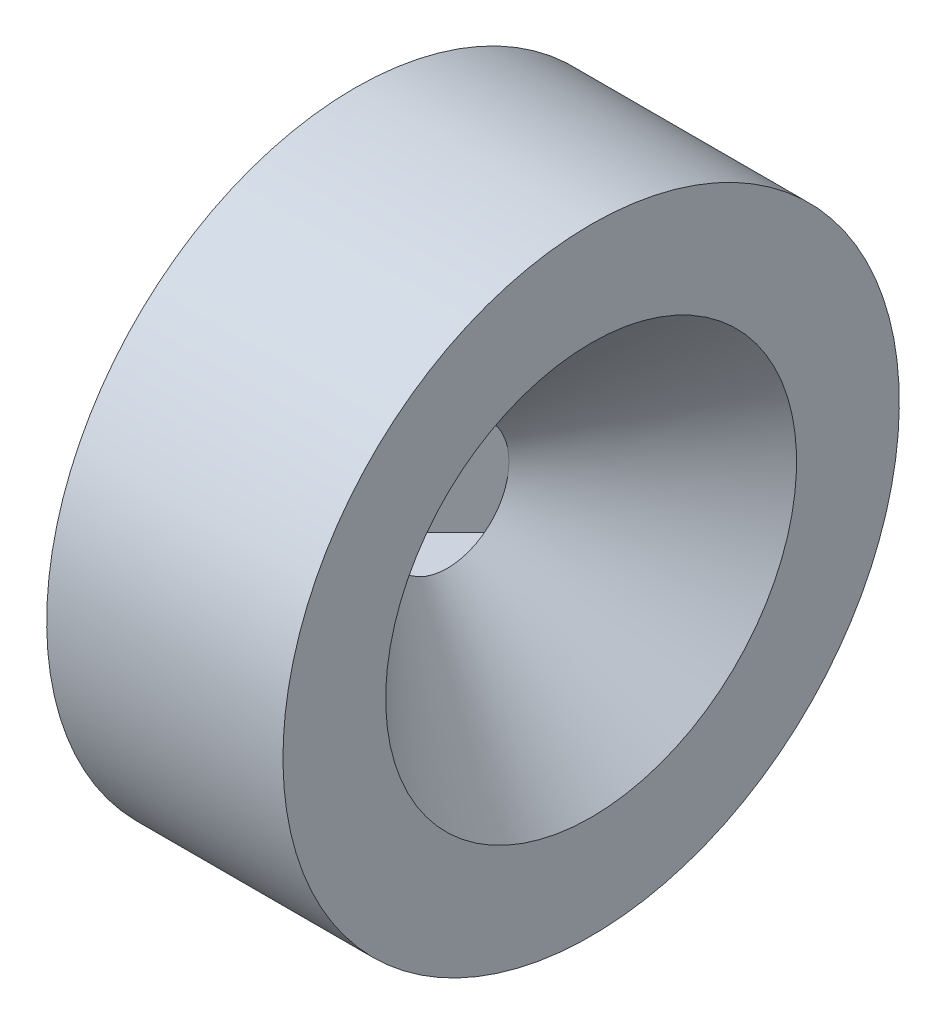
ISO-10303-21;
HEADER;
FILE_DESCRIPTION(('STEP AP214'),'2;1');
FILE_NAME('part.step','',(''),(''),'','','');
FILE_SCHEMA(('AUTOMOTIVE_DESIGN { 1 0 10303 214 1 1 1 1 }'));
ENDSEC;
DATA;
#1=APPLICATION_CONTEXT('core data for automotive mechanical design processes');
#2=APPLICATION_PROTOCOL_DEFINITION('international standard','automotive_design',2000,#1);
#3=PRODUCT_CONTEXT('',#1,'mechanical');
#4=PRODUCT('Part','Part','',(#3));
#5=PRODUCT_RELATED_PRODUCT_CATEGORY('part','',(#4));
#6=PRODUCT_DEFINITION_FORMATION('','',#4);
#7=PRODUCT_DEFINITION_CONTEXT('part definition',#1,'design');
#8=PRODUCT_DEFINITION('design','',#6,#7);
#9=PRODUCT_DEFINITION_SHAPE('','',#8);
#10=(LENGTH_UNIT() NAMED_UNIT(*) SI_UNIT(.MILLI.,.METRE.));
#11=(NAMED_UNIT(*) PLANE_ANGLE_UNIT() SI_UNIT($,.RADIAN.));
#12=(NAMED_UNIT(*) SI_UNIT($,.STERADIAN.) SOLID_ANGLE_UNIT());
#13=UNCERTAINTY_MEASURE_WITH_UNIT(LENGTH_MEASURE(1.E-05),#10,'distance_accuracy_value','');
#14=(GEOMETRIC_REPRESENTATION_CONTEXT(3) GLOBAL_UNCERTAINTY_ASSIGNED_CONTEXT((#13)) GLOBAL_UNIT_ASSIGNED_CONTEXT((#10,
#11,#12)) REPRESENTATION_CONTEXT('',''));
#15=CARTESIAN_POINT('',(0.,0.,0.));
#16=DIRECTION('',(0.,0.,1.));
#17=DIRECTION('',(1.,0.,0.));
#18=AXIS2_PLACEMENT_3D('',#15,#16,#17);
#19=CARTESIAN_POINT('',(4.5,-3.,3.));
#20=DIRECTION('',(1.,0.,0.));
#21=DIRECTION('',(0.,0.,-1.));
#22=AXIS2_PLACEMENT_3D('',#19,#20,#21);
#23=PLANE('',#22);
#24=CARTESIAN_POINT('',(4.49999999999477,0.,0.));
#25=DIRECTION('',(-1.,0.,0.));
#26=DIRECTION('',(0.,-1.,0.));
#27=AXIS2_PLACEMENT_3D('',#24,#25,#26);
#28=CIRCLE('',#27,2.99999999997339);
#29=CARTESIAN_POINT('',(4.49999999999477,-2.99999999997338,0.));
#30=VERTEX_POINT('',#29);
#31=CARTESIAN_POINT('',(4.49999999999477,0.,2.99999999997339));
#32=VERTEX_POINT('',#31);
#33=EDGE_CURVE('E88',#30,#32,#28,.T.);
#34=ORIENTED_EDGE('',*,*,#33,.F.);
#35=DIRECTION('',(0.,0.,-1.));
#36=VECTOR('',#35,1.);
#37=CARTESIAN_POINT('',(4.5,-3.,3.));
#38=LINE('',#37,#36);
#39=CARTESIAN_POINT('',(4.5,-3.,3.));
#40=VERTEX_POINT('',#39);
#41=EDGE_CURVE('E102',#40,#30,#38,.T.);
#42=ORIENTED_EDGE('',*,*,#41,.F.);
#43=DIRECTION('',(0.,1.,0.));
#44=VECTOR('',#43,1.);
#45=CARTESIAN_POINT('',(4.5,-3.,3.));
#46=LINE('',#45,#44);
#47=EDGE_CURVE('E104',#40,#32,#46,.T.);
#48=ORIENTED_EDGE('',*,*,#47,.T.);
#49=EDGE_LOOP('',(#34,#42,#48));
#50=FACE_BOUND('',#49,.T.);
#51=ADVANCED_FACE('F33',(#50),#23,.F.);
#52=CARTESIAN_POINT('',(4.49999999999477,2.9999999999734,0.));
#53=VERTEX_POINT('',#52);
#54=EDGE_CURVE('E106',#32,#53,#28,.T.);
#55=ORIENTED_EDGE('',*,*,#54,.F.);
#56=CARTESIAN_POINT('',(4.5,3.,3.));
#57=VERTEX_POINT('',#56);
#58=EDGE_CURVE('E132',#32,#57,#46,.T.);
#59=ORIENTED_EDGE('',*,*,#58,.T.);
#60=DIRECTION('',(0.,0.,-1.));
#61=VECTOR('',#60,1.);
#62=CARTESIAN_POINT('',(4.5,3.,3.));
#63=LINE('',#62,#61);
#64=EDGE_CURVE('E123',#57,#53,#63,.T.);
#65=ORIENTED_EDGE('',*,*,#64,.T.);
#66=EDGE_LOOP('',(#55,#59,#65));
#67=FACE_BOUND('',#66,.T.);
#68=ADVANCED_FACE('F160',(#67),#23,.F.);
#69=CARTESIAN_POINT('',(4.49999999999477,0.,-3.));
#70=VERTEX_POINT('',#69);
#71=EDGE_CURVE('E91',#53,#70,#28,.T.);
#72=ORIENTED_EDGE('',*,*,#71,.F.);
#73=CARTESIAN_POINT('',(4.5,3.,-3.));
#74=VERTEX_POINT('',#73);
#75=EDGE_CURVE('E127',#53,#74,#63,.T.);
#76=ORIENTED_EDGE('',*,*,#75,.T.);
#77=DIRECTION('',(0.,1.,0.));
#78=VECTOR('',#77,1.);
#79=CARTESIAN_POINT('',(4.5,-3.,-3.));
#80=LINE('',#79,#78);
#81=EDGE_CURVE('E122',#70,#74,#80,.T.);
#82=ORIENTED_EDGE('',*,*,#81,.F.);
#83=EDGE_LOOP('',(#72,#76,#82));
#84=FACE_BOUND('',#83,.T.);
#85=ADVANCED_FACE('F203',(#84),#23,.F.);
#86=EDGE_CURVE('E85',#70,#30,#28,.T.);
#87=ORIENTED_EDGE('',*,*,#86,.F.);
#88=CARTESIAN_POINT('',(4.5,-3.,-3.));
#89=VERTEX_POINT('',#88);
#90=EDGE_CURVE('E110',#89,#70,#80,.T.);
#91=ORIENTED_EDGE('',*,*,#90,.F.);
#92=EDGE_CURVE('E107',#30,#89,#38,.T.);
#93=ORIENTED_EDGE('',*,*,#92,.F.);
#94=EDGE_LOOP('',(#87,#91,#93));
#95=FACE_BOUND('',#94,.T.);
#96=ADVANCED_FACE('F108',(#95),#23,.F.);
#97=CARTESIAN_POINT('',(1.5,-3.,0.));
#98=DIRECTION('',(-0.707106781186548,0.,0.707106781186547));
#99=DIRECTION('',(0.707106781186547,0.,0.707106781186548));
#100=AXIS2_PLACEMENT_3D('',#97,#98,#99);
#101=PLANE('',#100);
#102=DIRECTION('',(0.707106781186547,0.,0.707106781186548));
#103=VECTOR('',#102,1.);
#104=CARTESIAN_POINT('',(1.5,-3.,0.));
#105=LINE('',#104,#103);
#106=CARTESIAN_POINT('',(1.64142135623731,-3.,0.141421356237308));
#107=VERTEX_POINT('',#106);
#108=EDGE_CURVE('E116',#107,#40,#105,.T.);
#109=ORIENTED_EDGE('',*,*,#108,.F.);
#110=DIRECTION('',(0.,1.,0.));
#111=VECTOR('',#110,1.);
#112=CARTESIAN_POINT('',(1.64142135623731,3.,0.141421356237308));
#113=LINE('',#112,#111);
#114=CARTESIAN_POINT('',(1.64142135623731,3.,0.141421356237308));
#115=VERTEX_POINT('',#114);
#116=EDGE_CURVE('E145',#107,#115,#113,.T.);
#117=ORIENTED_EDGE('',*,*,#116,.T.);
#118=DIRECTION('',(0.707106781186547,0.,0.707106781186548));
#119=VECTOR('',#118,1.);
#120=CARTESIAN_POINT('',(1.5,3.,0.));
#121=LINE('',#120,#119);
#122=EDGE_CURVE('E112',#115,#57,#121,.T.);
#123=ORIENTED_EDGE('',*,*,#122,.T.);
#124=ORIENTED_EDGE('',*,*,#58,.F.);
#125=ORIENTED_EDGE('',*,*,#47,.F.);
#126=EDGE_LOOP('',(#109,#117,#123,#124,#125));
#127=FACE_BOUND('',#126,.T.);
#128=ADVANCED_FACE('F150',(#127),#101,.F.);
#129=CARTESIAN_POINT('',(4.5,-3.,-3.));
#130=DIRECTION('',(-0.707106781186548,0.,-0.707106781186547));
#131=DIRECTION('',(-0.707106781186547,0.,0.707106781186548));
#132=AXIS2_PLACEMENT_3D('',#129,#130,#131);
#133=PLANE('',#132);
#134=DIRECTION('',(-0.707106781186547,0.,0.707106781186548));
#135=VECTOR('',#134,1.);
#136=CARTESIAN_POINT('',(4.5,3.,-3.));
#137=LINE('',#136,#135);
#138=CARTESIAN_POINT('',(1.64142135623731,3.,-0.141421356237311));
#139=VERTEX_POINT('',#138);
#140=EDGE_CURVE('E126',#74,#139,#137,.T.);
#141=ORIENTED_EDGE('',*,*,#140,.T.);
#142=DIRECTION('',(0.,1.,0.));
#143=VECTOR('',#142,1.);
#144=CARTESIAN_POINT('',(1.64142135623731,-3.,-0.141421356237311));
#145=LINE('',#144,#143);
#146=CARTESIAN_POINT('',(1.64142135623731,-3.,-0.141421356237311));
#147=VERTEX_POINT('',#146);
#148=EDGE_CURVE('E41',#139,#147,#145,.F.);
#149=ORIENTED_EDGE('',*,*,#148,.T.);
#150=DIRECTION('',(-0.707106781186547,0.,0.707106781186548));
#151=VECTOR('',#150,1.);
#152=CARTESIAN_POINT('',(4.5,-3.,-3.));
#153=LINE('',#152,#151);
#154=EDGE_CURVE('E117',#89,#147,#153,.T.);
#155=ORIENTED_EDGE('',*,*,#154,.F.);
#156=ORIENTED_EDGE('',*,*,#90,.T.);
#157=ORIENTED_EDGE('',*,*,#81,.T.);
#158=EDGE_LOOP('',(#141,#149,#155,#156,#157));
#159=FACE_BOUND('',#158,.T.);
#160=ADVANCED_FACE('F210',(#159),#133,.F.);
#161=CARTESIAN_POINT('',(0.,-3.,0.));
#162=DIRECTION('',(0.,1.,0.));
#163=DIRECTION('',(0.,0.,1.));
#164=AXIS2_PLACEMENT_3D('',#161,#162,#163);
#165=PLANE('',#164);
#166=ORIENTED_EDGE('',*,*,#154,.T.);
#167=CARTESIAN_POINT('',(1.78284271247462,-3.,0.));
#168=DIRECTION('',(0.,1.,0.));
#169=DIRECTION('',(0.,0.,1.));
#170=AXIS2_PLACEMENT_3D('',#167,#168,#169);
#171=CIRCLE('',#170,0.2);
#172=EDGE_CURVE('E11',#147,#107,#171,.T.);
#173=ORIENTED_EDGE('',*,*,#172,.T.);
#174=ORIENTED_EDGE('',*,*,#108,.T.);
#175=ORIENTED_EDGE('',*,*,#41,.T.);
#176=ORIENTED_EDGE('',*,*,#92,.T.);
#177=EDGE_LOOP('',(#166,#173,#174,#175,#176));
#178=FACE_BOUND('',#177,.T.);
#179=ADVANCED_FACE('F114',(#178),#165,.T.);
#180=CARTESIAN_POINT('',(0.,3.,0.));
#181=DIRECTION('',(0.,1.,0.));
#182=DIRECTION('',(0.,0.,1.));
#183=AXIS2_PLACEMENT_3D('',#180,#181,#182);
#184=PLANE('',#183);
#185=ORIENTED_EDGE('',*,*,#122,.F.);
#186=CARTESIAN_POINT('',(1.78284271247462,3.,0.));
#187=DIRECTION('',(0.,1.,0.));
#188=DIRECTION('',(0.,0.,1.));
#189=AXIS2_PLACEMENT_3D('',#186,#187,#188);
#190=CIRCLE('',#189,0.2);
#191=EDGE_CURVE('E55',#115,#139,#190,.F.);
#192=ORIENTED_EDGE('',*,*,#191,.T.);
#193=ORIENTED_EDGE('',*,*,#140,.F.);
#194=ORIENTED_EDGE('',*,*,#75,.F.);
#195=ORIENTED_EDGE('',*,*,#64,.F.);
#196=EDGE_LOOP('',(#185,#192,#193,#194,#195));
#197=FACE_BOUND('',#196,.T.);
#198=ADVANCED_FACE('F156',(#197),#184,.F.);
#199=CARTESIAN_POINT('',(4.49999999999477,0.,0.));
#200=DIRECTION('',(1.,0.,0.));
#201=DIRECTION('',(0.,1.,0.));
#202=AXIS2_PLACEMENT_3D('',#199,#200,#201);
#203=CONICAL_SURFACE('',#202,2.99999999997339,0.785398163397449);
#204=CARTESIAN_POINT('',(11.4999999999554,0.,0.));
#205=DIRECTION('',(-1.,0.,0.));
#206=DIRECTION('',(0.,-1.,0.));
#207=AXIS2_PLACEMENT_3D('',#204,#205,#206);
#208=CIRCLE('',#207,9.99999999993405);
#209=CARTESIAN_POINT('',(11.4999999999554,-9.99999999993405,0.));
#210=VERTEX_POINT('',#209);
#211=EDGE_CURVE('E105',#210,#210,#208,.T.);
#212=ORIENTED_EDGE('',*,*,#211,.F.);
#213=EDGE_LOOP('',(#212));
#214=FACE_BOUND('',#213,.T.);
#215=ORIENTED_EDGE('',*,*,#33,.T.);
#216=ORIENTED_EDGE('',*,*,#54,.T.);
#217=ORIENTED_EDGE('',*,*,#71,.T.);
#218=ORIENTED_EDGE('',*,*,#86,.T.);
#219=EDGE_LOOP('',(#215,#216,#217,#218));
#220=FACE_BOUND('',#219,.T.);
#221=ADVANCED_FACE('F87',(#214,#220),#203,.F.);
#222=CARTESIAN_POINT('',(0.,15.,0.));
#223=DIRECTION('',(-1.,0.,0.));
#224=DIRECTION('',(0.,-1.,0.));
#225=AXIS2_PLACEMENT_3D('',#222,#223,#224);
#226=PLANE('',#225);
#227=CARTESIAN_POINT('',(0.,0.,0.));
#228=DIRECTION('',(1.,0.,0.));
#229=DIRECTION('',(0.,1.,0.));
#230=AXIS2_PLACEMENT_3D('',#227,#228,#229);
#231=CIRCLE('',#230,15.);
#232=CARTESIAN_POINT('',(0.,15.,0.));
#233=VERTEX_POINT('',#232);
#234=EDGE_CURVE('E142',#233,#233,#231,.T.);
#235=ORIENTED_EDGE('',*,*,#234,.F.);
#236=EDGE_LOOP('',(#235));
#237=FACE_BOUND('',#236,.T.);
#238=CARTESIAN_POINT('',(0.,0.,0.));
#239=DIRECTION('',(-1.,0.,0.));
#240=DIRECTION('',(0.,-1.,0.));
#241=AXIS2_PLACEMENT_3D('',#238,#239,#240);
#242=CIRCLE('',#241,6.);
#243=CARTESIAN_POINT('',(0.,6.,0.));
#244=VERTEX_POINT('',#243);
#245=EDGE_CURVE('E131',#244,#244,#242,.T.);
#246=ORIENTED_EDGE('',*,*,#245,.F.);
#247=EDGE_LOOP('',(#246));
#248=FACE_BOUND('',#247,.T.);
#249=ADVANCED_FACE('F184',(#237,#248),#226,.T.);
#250=CARTESIAN_POINT('',(0.,0.,0.));
#251=DIRECTION('',(1.,0.,0.));
#252=DIRECTION('',(0.,1.,0.));
#253=AXIS2_PLACEMENT_3D('',#250,#251,#252);
#254=CYLINDRICAL_SURFACE('',#253,15.);
#255=ORIENTED_EDGE('',*,*,#234,.T.);
#256=EDGE_LOOP('',(#255));
#257=FACE_BOUND('',#256,.T.);
#258=CARTESIAN_POINT('',(11.5,0.,0.));
#259=DIRECTION('',(1.,0.,0.));
#260=DIRECTION('',(0.,1.,0.));
#261=AXIS2_PLACEMENT_3D('',#258,#259,#260);
#262=CIRCLE('',#261,15.);
#263=CARTESIAN_POINT('',(11.5,15.,0.));
#264=VERTEX_POINT('',#263);
#265=EDGE_CURVE('E137',#264,#264,#262,.T.);
#266=ORIENTED_EDGE('',*,*,#265,.F.);
#267=EDGE_LOOP('',(#266));
#268=FACE_BOUND('',#267,.T.);
#269=ADVANCED_FACE('F186',(#257,#268),#254,.T.);
#270=CARTESIAN_POINT('',(11.5,0.,0.));
#271=DIRECTION('',(1.,0.,0.));
#272=DIRECTION('',(0.,1.,0.));
#273=AXIS2_PLACEMENT_3D('',#270,#271,#272);
#274=PLANE('',#273);
#275=ORIENTED_EDGE('',*,*,#211,.T.);
#276=EDGE_LOOP('',(#275));
#277=FACE_BOUND('',#276,.T.);
#278=ORIENTED_EDGE('',*,*,#265,.T.);
#279=EDGE_LOOP('',(#278));
#280=FACE_BOUND('',#279,.T.);
#281=ADVANCED_FACE('F180',(#277,#280),#274,.T.);
#282=CARTESIAN_POINT('',(-5.,0.,0.));
#283=DIRECTION('',(1.,0.,0.));
#284=DIRECTION('',(0.,1.,0.));
#285=AXIS2_PLACEMENT_3D('',#282,#283,#284);
#286=CYLINDRICAL_SURFACE('',#285,6.);
#287=CARTESIAN_POINT('',(-5.,0.,0.));
#288=DIRECTION('',(-1.,0.,0.));
#289=DIRECTION('',(0.,-1.,0.));
#290=AXIS2_PLACEMENT_3D('',#287,#288,#289);
#291=CIRCLE('',#290,6.);
#292=CARTESIAN_POINT('',(-5.,6.,0.));
#293=VERTEX_POINT('',#292);
#294=EDGE_CURVE('E134',#293,#293,#291,.T.);
#295=CARTESIAN_POINT('',(-5.,6.,0.));
#296=CARTESIAN_POINT('',(-4.94791666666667,6.,0.));
#297=CARTESIAN_POINT('',(-4.89583333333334,6.,0.));
#298=CARTESIAN_POINT('',(-4.79166666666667,6.,0.));
#299=CARTESIAN_POINT('',(-4.73958333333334,6.,0.));
#300=CARTESIAN_POINT('',(-4.63541666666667,6.,0.));
#301=CARTESIAN_POINT('',(-4.58333333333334,6.,0.));
#302=CARTESIAN_POINT('',(-4.47916666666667,6.,0.));
#303=CARTESIAN_POINT('',(-4.42708333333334,6.,0.));
#304=CARTESIAN_POINT('',(-4.32291666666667,6.,0.));
#305=CARTESIAN_POINT('',(-4.27083333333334,6.,0.));
#306=CARTESIAN_POINT('',(-4.16666666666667,6.,0.));
#307=CARTESIAN_POINT('',(-4.11458333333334,6.,0.));
#308=CARTESIAN_POINT('',(-4.01041666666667,6.,0.));
#309=CARTESIAN_POINT('',(-3.95833333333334,6.,0.));
#310=CARTESIAN_POINT('',(-3.85416666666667,6.,0.));
#311=CARTESIAN_POINT('',(-3.80208333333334,6.,0.));
#312=CARTESIAN_POINT('',(-3.69791666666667,6.,0.));
#313=CARTESIAN_POINT('',(-3.64583333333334,6.,0.));
#314=CARTESIAN_POINT('',(-3.54166666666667,6.,0.));
#315=CARTESIAN_POINT('',(-3.48958333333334,6.,0.));
#316=CARTESIAN_POINT('',(-3.38541666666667,6.,0.));
#317=CARTESIAN_POINT('',(-3.33333333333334,6.,0.));
#318=CARTESIAN_POINT('',(-3.22916666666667,6.,0.));
#319=CARTESIAN_POINT('',(-3.17708333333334,6.,0.));
#320=CARTESIAN_POINT('',(-3.07291666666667,6.,0.));
#321=CARTESIAN_POINT('',(-3.02083333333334,6.,0.));
#322=CARTESIAN_POINT('',(-2.91666666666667,6.,0.));
#323=CARTESIAN_POINT('',(-2.86458333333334,6.,0.));
#324=CARTESIAN_POINT('',(-2.76041666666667,6.,0.));
#325=CARTESIAN_POINT('',(-2.70833333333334,6.,0.));
#326=CARTESIAN_POINT('',(-2.60416666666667,6.,0.));
#327=CARTESIAN_POINT('',(-2.55208333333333,6.,0.));
#328=CARTESIAN_POINT('',(-2.44791666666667,6.,0.));
#329=CARTESIAN_POINT('',(-2.39583333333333,6.,0.));
#330=CARTESIAN_POINT('',(-2.29166666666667,6.,0.));
#331=CARTESIAN_POINT('',(-2.23958333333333,6.,0.));
#332=CARTESIAN_POINT('',(-2.13541666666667,6.,0.));
#333=CARTESIAN_POINT('',(-2.08333333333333,6.,0.));
#334=CARTESIAN_POINT('',(-1.97916666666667,6.,0.));
#335=CARTESIAN_POINT('',(-1.92708333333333,6.,0.));
#336=CARTESIAN_POINT('',(-1.82291666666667,6.,0.));
#337=CARTESIAN_POINT('',(-1.77083333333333,6.,0.));
#338=CARTESIAN_POINT('',(-1.66666666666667,6.,0.));
#339=CARTESIAN_POINT('',(-1.61458333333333,6.,0.));
#340=CARTESIAN_POINT('',(-1.51041666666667,6.,0.));
#341=CARTESIAN_POINT('',(-1.45833333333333,6.,0.));
#342=CARTESIAN_POINT('',(-1.35416666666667,6.,0.));
#343=CARTESIAN_POINT('',(-1.30208333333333,6.,0.));
#344=CARTESIAN_POINT('',(-1.19791666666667,6.,0.));
#345=CARTESIAN_POINT('',(-1.14583333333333,6.,0.));
#346=CARTESIAN_POINT('',(-1.04166666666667,6.,0.));
#347=CARTESIAN_POINT('',(-0.989583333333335,6.,0.));
#348=CARTESIAN_POINT('',(-0.885416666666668,6.,0.));
#349=CARTESIAN_POINT('',(-0.833333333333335,6.,0.));
#350=CARTESIAN_POINT('',(-0.729166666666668,6.,0.));
#351=CARTESIAN_POINT('',(-0.677083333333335,6.,0.));
#352=CARTESIAN_POINT('',(-0.572916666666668,6.,0.));
#353=CARTESIAN_POINT('',(-0.520833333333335,6.,0.));
#354=CARTESIAN_POINT('',(-0.416666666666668,6.,0.));
#355=CARTESIAN_POINT('',(-0.364583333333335,6.,0.));
#356=CARTESIAN_POINT('',(-0.260416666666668,6.,0.));
#357=CARTESIAN_POINT('',(-0.208333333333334,6.,0.));
#358=CARTESIAN_POINT('',(-0.104166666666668,6.,0.));
#359=CARTESIAN_POINT('',(-0.0520833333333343,6.,0.));
#360=CARTESIAN_POINT('',(0.,6.,0.));
#361=B_SPLINE_CURVE_WITH_KNOTS('',3,(#295,#296,#297,#298,#299,#300,#301,#302,#303,#304,#305,
#306,#307,#308,#309,#310,#311,#312,#313,#314,#315,#316,#317,#318,#319,#320,#321,#322,#323,#324,
#325,#326,#327,#328,#329,#330,#331,#332,#333,#334,#335,#336,#337,#338,#339,#340,#341,#342,#343,
#344,#345,#346,#347,#348,#349,#350,#351,#352,#353,#354,#355,#356,#357,#358,#359,#360),
.UNSPECIFIED.,.F.,.F.,(4,2,2,2,2,2,2,2,2,2,2,2,2,2,2,2,2,2,2,2,2,2,2,2,2,2,2,2,2,2,2,2,4),(0.,
0.15625,0.3125,0.46875,0.625000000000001,0.781250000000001,0.937500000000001,1.09375,1.25,
1.40625,1.5625,1.71875,1.875,2.03125,2.1875,2.34375,2.5,2.65625,2.8125,2.96875,3.125,3.28125,
3.4375,3.59375,3.75,3.90625,4.0625,4.21875,4.375,4.53125,4.6875,4.84375,5.),.UNSPECIFIED.);
#362=EDGE_CURVE('BSEAM174',#293,#244,#361,.T.);
#363=ORIENTED_EDGE('',*,*,#294,.F.);
#364=ORIENTED_EDGE('',*,*,#245,.T.);
#365=ORIENTED_EDGE('',*,*,#362,.T.);
#366=ORIENTED_EDGE('',*,*,#362,.F.);
#367=EDGE_LOOP('',(#363,#365,#364,#366));
#368=FACE_BOUND('',#367,.T.);
#369=ADVANCED_FACE('F174',(#368),#286,.T.);
#370=CARTESIAN_POINT('',(-5.,0.,0.));
#371=DIRECTION('',(-1.,0.,0.));
#372=DIRECTION('',(0.,-1.,0.));
#373=AXIS2_PLACEMENT_3D('',#370,#371,#372);
#374=PLANE('',#373);
#375=CARTESIAN_POINT('',(-5.,0.,0.));
#376=DIRECTION('',(-1.,0.,0.));
#377=DIRECTION('',(0.,0.,1.));
#378=AXIS2_PLACEMENT_3D('',#375,#376,#377);
#379=CIRCLE('',#378,4.99999999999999);
#380=CARTESIAN_POINT('',(-5.,0.,4.99999999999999));
#381=VERTEX_POINT('',#380);
#382=EDGE_CURVE('E164',#381,#381,#379,.T.);
#383=ORIENTED_EDGE('',*,*,#382,.F.);
#384=EDGE_LOOP('',(#383));
#385=FACE_BOUND('',#384,.T.);
#386=ORIENTED_EDGE('',*,*,#294,.T.);
#387=EDGE_LOOP('',(#386));
#388=FACE_BOUND('',#387,.T.);
#389=ADVANCED_FACE('F170',(#385,#388),#374,.T.);
#390=CARTESIAN_POINT('',(0.,0.,0.));
#391=DIRECTION('',(1.,0.,0.));
#392=DIRECTION('',(0.,0.,-1.));
#393=AXIS2_PLACEMENT_3D('',#390,#391,#392);
#394=PLANE('',#393);
#395=CARTESIAN_POINT('',(0.,0.,0.));
#396=DIRECTION('',(-1.,0.,0.));
#397=DIRECTION('',(0.,0.,1.));
#398=AXIS2_PLACEMENT_3D('',#395,#396,#397);
#399=CIRCLE('',#398,4.99999999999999);
#400=CARTESIAN_POINT('',(0.,0.,4.99999999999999));
#401=VERTEX_POINT('',#400);
#402=EDGE_CURVE('E96',#401,#401,#399,.T.);
#403=ORIENTED_EDGE('',*,*,#402,.T.);
#404=EDGE_LOOP('',(#403));
#405=FACE_BOUND('',#404,.T.);
#406=ADVANCED_FACE('F173',(#405),#394,.F.);
#407=CARTESIAN_POINT('',(-5.,0.,0.));
#408=DIRECTION('',(-1.,0.,0.));
#409=DIRECTION('',(0.,0.,1.));
#410=AXIS2_PLACEMENT_3D('',#407,#408,#409);
#411=CYLINDRICAL_SURFACE('',#410,4.99999999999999);
#412=ORIENTED_EDGE('',*,*,#402,.F.);
#413=EDGE_LOOP('',(#412));
#414=FACE_BOUND('',#413,.T.);
#415=ORIENTED_EDGE('',*,*,#382,.T.);
#416=EDGE_LOOP('',(#415));
#417=FACE_BOUND('',#416,.T.);
#418=ADVANCED_FACE('F168',(#414,#417),#411,.F.);
#419=CARTESIAN_POINT('',(1.78284271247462,-3.,0.));
#420=DIRECTION('',(0.,-1.,0.));
#421=DIRECTION('',(0.,0.,-1.));
#422=AXIS2_PLACEMENT_3D('',#419,#420,#421);
#423=CYLINDRICAL_SURFACE('',#422,0.2);
#424=ORIENTED_EDGE('',*,*,#172,.F.);
#425=ORIENTED_EDGE('',*,*,#148,.F.);
#426=ORIENTED_EDGE('',*,*,#191,.F.);
#427=ORIENTED_EDGE('',*,*,#116,.F.);
#428=EDGE_LOOP('',(#424,#425,#426,#427));
#429=FACE_BOUND('',#428,.T.);
#430=ADVANCED_FACE('F35',(#429),#423,.F.);
#431=CLOSED_SHELL('',(#51,#68,#85,#96,#128,#160,#179,#198,#221,#249,#269,#281,#369,#389,#406,
#418,#430));
#432=MANIFOLD_SOLID_BREP('B2',#431);
#433=ADVANCED_BREP_SHAPE_REPRESENTATION('',(#18,#432),#14);
#434=SHAPE_DEFINITION_REPRESENTATION(#9,#433);
ENDSEC;
END-ISO-10303-21;
